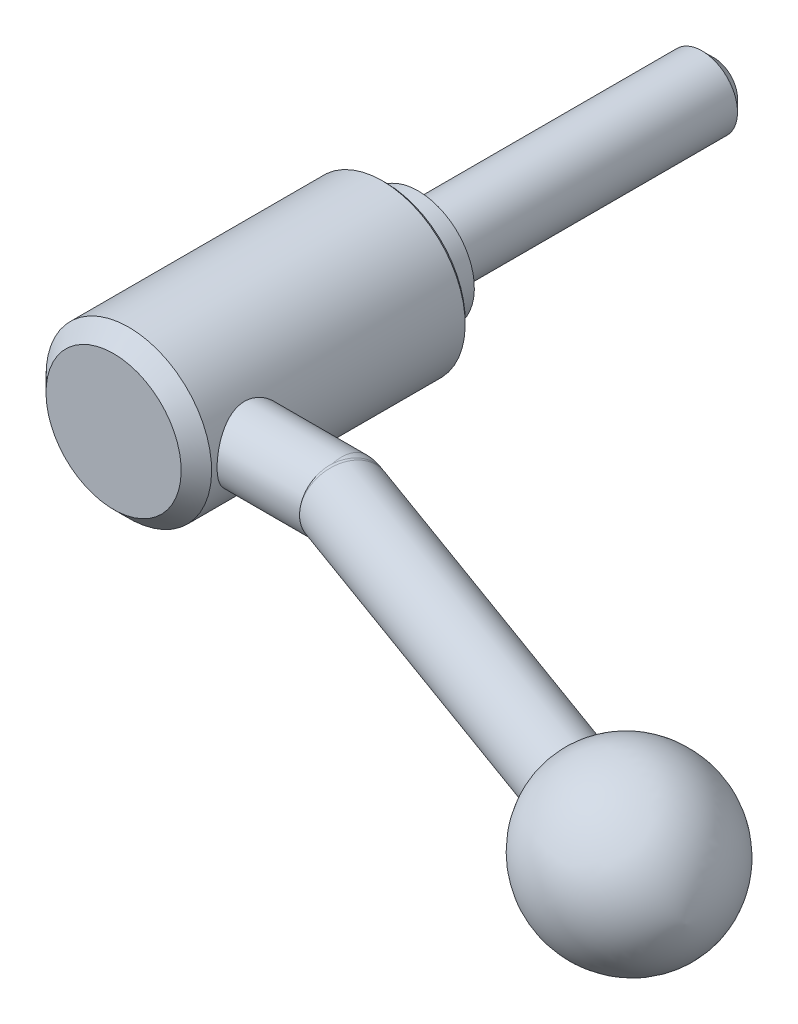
ISO-10303-21;
HEADER;
FILE_DESCRIPTION(('STEP AP214'),'2;1');
FILE_NAME('part.step','',(''),(''),'','','');
FILE_SCHEMA(('AUTOMOTIVE_DESIGN { 1 0 10303 214 1 1 1 1 }'));
ENDSEC;
DATA;
#1=APPLICATION_CONTEXT('core data for automotive mechanical design processes');
#2=APPLICATION_PROTOCOL_DEFINITION('international standard','automotive_design',2000,#1);
#3=PRODUCT_CONTEXT('',#1,'mechanical');
#4=PRODUCT('Part','Part','',(#3));
#5=PRODUCT_RELATED_PRODUCT_CATEGORY('part','',(#4));
#6=PRODUCT_DEFINITION_FORMATION('','',#4);
#7=PRODUCT_DEFINITION_CONTEXT('part definition',#1,'design');
#8=PRODUCT_DEFINITION('design','',#6,#7);
#9=PRODUCT_DEFINITION_SHAPE('','',#8);
#10=(LENGTH_UNIT() NAMED_UNIT(*) SI_UNIT(.MILLI.,.METRE.));
#11=(NAMED_UNIT(*) PLANE_ANGLE_UNIT() SI_UNIT($,.RADIAN.));
#12=(NAMED_UNIT(*) SI_UNIT($,.STERADIAN.) SOLID_ANGLE_UNIT());
#13=UNCERTAINTY_MEASURE_WITH_UNIT(LENGTH_MEASURE(1.E-05),#10,'distance_accuracy_value','');
#14=(GEOMETRIC_REPRESENTATION_CONTEXT(3) GLOBAL_UNCERTAINTY_ASSIGNED_CONTEXT((#13)) GLOBAL_UNIT_ASSIGNED_CONTEXT((#10,
#11,#12)) REPRESENTATION_CONTEXT('',''));
#15=CARTESIAN_POINT('',(0.,0.,0.));
#16=DIRECTION('',(0.,0.,1.));
#17=DIRECTION('',(1.,0.,0.));
#18=AXIS2_PLACEMENT_3D('',#15,#16,#17);
#19=CARTESIAN_POINT('',(0.,0.,0.));
#20=DIRECTION('',(0.,0.,-1.));
#21=DIRECTION('',(0.,1.,0.));
#22=AXIS2_PLACEMENT_3D('',#19,#20,#21);
#23=CYLINDRICAL_SURFACE('',#22,14.);
#24=CARTESIAN_POINT('',(0.,0.,6.05));
#25=DIRECTION('',(0.,0.,-1.));
#26=DIRECTION('',(0.,1.,0.));
#27=AXIS2_PLACEMENT_3D('',#24,#25,#26);
#28=CIRCLE('',#27,14.);
#29=CARTESIAN_POINT('',(0.,14.,6.05));
#30=VERTEX_POINT('',#29);
#31=EDGE_CURVE('E160',#30,#30,#28,.T.);
#32=ORIENTED_EDGE('',*,*,#31,.F.);
#33=EDGE_LOOP('',(#32));
#34=FACE_BOUND('',#33,.T.);
#35=CARTESIAN_POINT('',(12.6491106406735,6.,42.));
#36=CARTESIAN_POINT('',(12.6491119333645,5.99999879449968,42.1596004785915));
#37=CARTESIAN_POINT('',(12.6521417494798,5.99362272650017,42.319252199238));
#38=CARTESIAN_POINT('',(12.6641604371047,5.96818497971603,42.6373858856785));
#39=CARTESIAN_POINT('',(12.6731530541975,5.9491153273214,42.7958670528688));
#40=CARTESIAN_POINT('',(12.6968113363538,5.89845433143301,43.1107250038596));
#41=CARTESIAN_POINT('',(12.7114886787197,5.86683721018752,43.2670967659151));
#42=CARTESIAN_POINT('',(12.7460281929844,5.79141457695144,43.5763457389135));
#43=CARTESIAN_POINT('',(12.7658925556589,5.74760391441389,43.7292214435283));
#44=CARTESIAN_POINT('',(12.8100655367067,5.64846416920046,44.029718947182));
#45=CARTESIAN_POINT('',(12.834352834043,5.59319017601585,44.177362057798));
#46=CARTESIAN_POINT('',(12.8867070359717,5.47148691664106,44.467303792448));
#47=CARTESIAN_POINT('',(12.9147753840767,5.40505338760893,44.6096003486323));
#48=CARTESIAN_POINT('',(13.0034453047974,5.18984372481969,45.0271066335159));
#49=CARTESIAN_POINT('',(13.0685687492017,5.02503655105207,45.2932994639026));
#50=CARTESIAN_POINT('',(13.2082270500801,4.64606142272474,45.8109410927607));
#51=CARTESIAN_POINT('',(13.2830918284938,4.42953098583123,46.0605561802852));
#52=CARTESIAN_POINT('',(13.4311425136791,3.95794082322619,46.5214200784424));
#53=CARTESIAN_POINT('',(13.5043277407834,3.70286580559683,46.7326535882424));
#54=CARTESIAN_POINT('',(13.6088499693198,3.28949768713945,47.0208851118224));
#55=CARTESIAN_POINT('',(13.6435186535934,3.14296205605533,47.11390422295));
#56=CARTESIAN_POINT('',(13.7094062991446,2.84181000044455,47.2871776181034));
#57=CARTESIAN_POINT('',(13.7406265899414,2.68719672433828,47.3674368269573));
#58=CARTESIAN_POINT('',(13.798716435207,2.37092404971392,47.5144478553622));
#59=CARTESIAN_POINT('',(13.8255866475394,2.2092657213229,47.5812017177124));
#60=CARTESIAN_POINT('',(13.8741880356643,1.88004748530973,47.7005320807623));
#61=CARTESIAN_POINT('',(13.895919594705,1.71248801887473,47.7531096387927));
#62=CARTESIAN_POINT('',(13.9325503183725,1.38207962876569,47.8410157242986));
#63=CARTESIAN_POINT('',(13.9477579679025,1.21947370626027,47.8771298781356));
#64=CARTESIAN_POINT('',(13.9725603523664,0.891408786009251,47.9357518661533));
#65=CARTESIAN_POINT('',(13.9821554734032,0.725949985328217,47.9582606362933));
#66=CARTESIAN_POINT('',(13.9954554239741,0.393553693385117,47.9894048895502));
#67=CARTESIAN_POINT('',(13.9991623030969,0.226616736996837,47.9980452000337));
#68=CARTESIAN_POINT('',(14.0005839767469,-0.107418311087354,48.0013627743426));
#69=CARTESIAN_POINT('',(13.9982990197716,-0.274516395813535,47.996040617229));
#70=CARTESIAN_POINT('',(13.9881447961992,-0.596733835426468,47.9722942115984));
#71=CARTESIAN_POINT('',(13.9806457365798,-0.751929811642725,47.9547383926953));
#72=CARTESIAN_POINT('',(13.9606520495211,-1.06021754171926,47.9076442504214));
#73=CARTESIAN_POINT('',(13.9481558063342,-1.21330859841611,47.8781020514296));
#74=CARTESIAN_POINT('',(13.9184825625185,-1.51624558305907,47.807339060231));
#75=CARTESIAN_POINT('',(13.9013071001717,-1.66609256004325,47.7661221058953));
#76=CARTESIAN_POINT('',(13.8626834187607,-1.96169333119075,47.6723729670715));
#77=CARTESIAN_POINT('',(13.8412335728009,-2.10744554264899,47.6198364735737));
#78=CARTESIAN_POINT('',(13.7942200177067,-2.39607632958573,47.5030361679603));
#79=CARTESIAN_POINT('',(13.7685998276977,-2.53887984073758,47.4386094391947));
#80=CARTESIAN_POINT('',(13.7140859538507,-2.81854325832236,47.2990820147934));
#81=CARTESIAN_POINT('',(13.6851910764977,-2.9554009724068,47.2239774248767));
#82=CARTESIAN_POINT('',(13.5945766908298,-3.35592063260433,46.9834369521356));
#83=CARTESIAN_POINT('',(13.5288965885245,-3.60971063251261,46.8027004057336));
#84=CARTESIAN_POINT('',(13.3878711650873,-4.10313412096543,46.3903719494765));
#85=CARTESIAN_POINT('',(13.3121702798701,-4.34033236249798,46.1560074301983));
#86=CARTESIAN_POINT('',(13.1631451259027,-4.77326595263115,45.6505491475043));
#87=CARTESIAN_POINT('',(13.0898218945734,-4.96898340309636,45.3794396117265));
#88=CARTESIAN_POINT('',(12.9865629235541,-5.2305288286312,44.9447706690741));
#89=CARTESIAN_POINT('',(12.9527260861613,-5.31354333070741,44.7922272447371));
#90=CARTESIAN_POINT('',(12.8890027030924,-5.46630143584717,44.4798640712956));
#91=CARTESIAN_POINT('',(12.8591145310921,-5.53605050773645,44.3200473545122));
#92=CARTESIAN_POINT('',(12.8043472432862,-5.66157110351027,43.9942625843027));
#93=CARTESIAN_POINT('',(12.7794661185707,-5.7173482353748,43.8282970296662));
#94=CARTESIAN_POINT('',(12.7356345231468,-5.81433157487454,43.4913958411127));
#95=CARTESIAN_POINT('',(12.7166834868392,-5.85553917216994,43.3204606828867));
#96=CARTESIAN_POINT('',(12.6865220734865,-5.9205872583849,42.9866991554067));
#97=CARTESIAN_POINT('',(12.6748757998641,-5.94541170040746,42.824103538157));
#98=CARTESIAN_POINT('',(12.6578221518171,-5.98163380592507,42.4971025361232));
#99=CARTESIAN_POINT('',(12.6524143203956,-5.99303245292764,42.3326972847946));
#100=CARTESIAN_POINT('',(12.6480404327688,-6.00225784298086,42.0034733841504));
#101=CARTESIAN_POINT('',(12.6490723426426,-6.00008887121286,41.8386548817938));
#102=CARTESIAN_POINT('',(12.6575345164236,-5.98221680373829,41.5099230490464));
#103=CARTESIAN_POINT('',(12.6649645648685,-5.96651416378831,41.3460096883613));
#104=CARTESIAN_POINT('',(12.685211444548,-5.92333782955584,41.0317850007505));
#105=CARTESIAN_POINT('',(12.6976163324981,-5.89676170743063,40.8813224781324));
#106=CARTESIAN_POINT('',(12.7273370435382,-5.83233654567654,40.5832773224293));
#107=CARTESIAN_POINT('',(12.7446544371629,-5.79448390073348,40.435695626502));
#108=CARTESIAN_POINT('',(12.7836779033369,-5.70787446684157,40.1443991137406));
#109=CARTESIAN_POINT('',(12.8053831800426,-5.65911965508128,40.0006836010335));
#110=CARTESIAN_POINT('',(12.8525781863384,-5.55109972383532,39.7178468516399));
#111=CARTESIAN_POINT('',(12.8780693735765,-5.49183055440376,39.5787274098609));
#112=CARTESIAN_POINT('',(12.9333207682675,-5.36045709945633,39.2999549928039));
#113=CARTESIAN_POINT('',(12.9632176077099,-5.28790975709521,39.160537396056));
#114=CARTESIAN_POINT('',(13.0255703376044,-5.13240219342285,38.8882359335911));
#115=CARTESIAN_POINT('',(13.0580270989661,-5.04943842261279,38.7553543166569));
#116=CARTESIAN_POINT('',(13.1580121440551,-4.78560208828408,38.3674196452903));
#117=CARTESIAN_POINT('',(13.2281845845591,-4.58971750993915,38.1229353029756));
#118=CARTESIAN_POINT('',(13.3366249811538,-4.26021445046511,37.7715869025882));
#119=CARTESIAN_POINT('',(13.3748529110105,-4.13892354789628,37.6527973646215));
#120=CARTESIAN_POINT('',(13.4503551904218,-3.88654904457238,37.4257795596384));
#121=CARTESIAN_POINT('',(13.4876298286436,-3.75546845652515,37.3175480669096));
#122=CARTESIAN_POINT('',(13.5602429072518,-3.48418488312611,37.1123202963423));
#123=CARTESIAN_POINT('',(13.5955803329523,-3.34397719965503,37.0153298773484));
#124=CARTESIAN_POINT('',(13.6633349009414,-3.05536185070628,36.8333913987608));
#125=CARTESIAN_POINT('',(13.6957533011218,-2.90695776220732,36.7484381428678));
#126=CARTESIAN_POINT('',(13.7569620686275,-2.60198219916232,36.5908122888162));
#127=CARTESIAN_POINT('',(13.78573175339,-2.44537070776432,36.5182089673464));
#128=CARTESIAN_POINT('',(13.8386034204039,-2.12585519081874,36.3865716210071));
#129=CARTESIAN_POINT('',(13.862707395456,-1.96295388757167,36.3275318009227));
#130=CARTESIAN_POINT('',(13.9055467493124,-1.63205123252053,36.2236281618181));
#131=CARTESIAN_POINT('',(13.9242837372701,-1.46405142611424,36.1787600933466));
#132=CARTESIAN_POINT('',(13.9558282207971,-1.12426022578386,36.1037042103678));
#133=CARTESIAN_POINT('',(13.9686361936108,-0.952469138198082,36.0735152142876));
#134=CARTESIAN_POINT('',(13.9872197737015,-0.619242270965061,36.0298514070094));
#135=CARTESIAN_POINT('',(13.9934418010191,-0.457969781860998,36.0153142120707));
#136=CARTESIAN_POINT('',(14.0002858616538,-0.134661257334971,35.9993285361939));
#137=CARTESIAN_POINT('',(14.0009081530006,0.0273747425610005,35.99787945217));
#138=CARTESIAN_POINT('',(13.9965361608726,0.350926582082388,36.008085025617));
#139=CARTESIAN_POINT('',(13.991542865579,0.512442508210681,36.0197373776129));
#140=CARTESIAN_POINT('',(13.976077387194,0.833743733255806,36.0560107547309));
#141=CARTESIAN_POINT('',(13.9656052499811,0.993529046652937,36.0806316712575));
#142=CARTESIAN_POINT('',(13.9399800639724,1.30393627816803,36.1413509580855));
#143=CARTESIAN_POINT('',(13.9250277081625,1.45467118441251,36.176958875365));
#144=CARTESIAN_POINT('',(13.89068609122,1.75251852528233,36.2595669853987));
#145=CARTESIAN_POINT('',(13.8712953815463,1.89962975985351,36.3065708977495));
#146=CARTESIAN_POINT('',(13.8285434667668,2.18924878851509,36.4115377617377));
#147=CARTESIAN_POINT('',(13.8051831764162,2.33175763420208,36.4694981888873));
#148=CARTESIAN_POINT('',(13.7550167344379,2.61145800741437,36.5959410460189));
#149=CARTESIAN_POINT('',(13.7282092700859,2.74864748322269,36.6644274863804));
#150=CARTESIAN_POINT('',(13.6704759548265,3.02301487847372,36.8147378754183));
#151=CARTESIAN_POINT('',(13.639418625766,3.1599112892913,36.8970251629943));
#152=CARTESIAN_POINT('',(13.5749315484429,3.42637329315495,37.0719801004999));
#153=CARTESIAN_POINT('',(13.5415009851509,3.55593634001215,37.1646513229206));
#154=CARTESIAN_POINT('',(13.4730570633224,3.80705581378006,37.3597829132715));
#155=CARTESIAN_POINT('',(13.4380434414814,3.9286109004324,37.4622449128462));
#156=CARTESIAN_POINT('',(13.3672591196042,4.16309810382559,37.6763643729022));
#157=CARTESIAN_POINT('',(13.3314883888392,4.27602986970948,37.7880222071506));
#158=CARTESIAN_POINT('',(13.257431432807,4.50061025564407,38.02841367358));
#159=CARTESIAN_POINT('',(13.2191519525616,4.61156500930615,38.1577987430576));
#160=CARTESIAN_POINT('',(13.1437838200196,4.82218384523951,38.4257073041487));
#161=CARTESIAN_POINT('',(13.1066947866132,4.92185156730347,38.5642278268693));
#162=CARTESIAN_POINT('',(13.0347422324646,5.10936324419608,38.8498227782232));
#163=CARTESIAN_POINT('',(12.9998810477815,5.19719489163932,38.9969058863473));
#164=CARTESIAN_POINT('',(12.9335248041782,5.36019403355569,39.2985749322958));
#165=CARTESIAN_POINT('',(12.9020282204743,5.43536727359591,39.4531574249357));
#166=CARTESIAN_POINT('',(12.8434648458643,5.57233851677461,39.7687244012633));
#167=CARTESIAN_POINT('',(12.8163926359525,5.63415291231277,39.9297007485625));
#168=CARTESIAN_POINT('',(12.7676047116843,5.74385568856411,40.2570433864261));
#169=CARTESIAN_POINT('',(12.7458863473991,5.79175096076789,40.4234069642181));
#170=CARTESIAN_POINT('',(12.7086612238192,5.87298255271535,40.7598587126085));
#171=CARTESIAN_POINT('',(12.6931381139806,5.90635721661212,40.9299358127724));
#172=CARTESIAN_POINT('',(12.6688496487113,5.95827833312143,41.2727263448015));
#173=CARTESIAN_POINT('',(12.6600791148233,5.97683614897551,41.4454376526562));
#174=CARTESIAN_POINT('',(12.6529445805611,5.99191158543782,41.6821226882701));
#175=CARTESIAN_POINT('',(12.6515079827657,5.99494373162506,41.7456483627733));
#176=CARTESIAN_POINT('',(12.6495907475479,5.998988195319,41.8727799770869));
#177=CARTESIAN_POINT('',(12.6491101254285,6.00000048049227,41.936385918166));
#178=CARTESIAN_POINT('',(12.6491106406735,6.,42.));
#179=B_SPLINE_CURVE_WITH_KNOTS('',3,(#35,#36,#37,#38,#39,#40,#41,#42,#43,#44,#45,#46,#47,#48,
#49,#50,#51,#52,#53,#54,#55,#56,#57,#58,#59,#60,#61,#62,#63,#64,#65,#66,#67,#68,#69,#70,#71,#72,
#73,#74,#75,#76,#77,#78,#79,#80,#81,#82,#83,#84,#85,#86,#87,#88,#89,#90,#91,#92,#93,#94,#95,#96,
#97,#98,#99,#100,#101,#102,#103,#104,#105,#106,#107,#108,#109,#110,#111,#112,#113,#114,#115,
#116,#117,#118,#119,#120,#121,#122,#123,#124,#125,#126,#127,#128,#129,#130,#131,#132,#133,#134,
#135,#136,#137,#138,#139,#140,#141,#142,#143,#144,#145,#146,#147,#148,#149,#150,#151,#152,#153,
#154,#155,#156,#157,#158,#159,#160,#161,#162,#163,#164,#165,#166,#167,#168,#169,#170,#171,#172,
#173,#174,#175,#176,#177,#178),.UNSPECIFIED.,.T.,.F.,(4,2,2,2,2,2,2,2,2,2,2,2,2,2,2,2,2,2,2,2,2,
2,2,2,2,2,2,2,2,2,2,2,2,2,2,2,2,2,2,2,2,2,2,2,2,2,2,2,2,2,2,2,2,2,2,2,2,2,2,2,2,2,2,2,2,2,2,2,2,
2,2,4),(0.,0.478735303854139,0.957771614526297,1.43779720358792,1.91802586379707,
2.39599804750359,2.87415322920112,3.82930565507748,4.84157827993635,5.85425356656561,
6.38467511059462,6.91489143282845,7.44502749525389,7.97512400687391,8.47625092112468,
8.9773433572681,9.47826133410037,9.97915853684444,10.4477041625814,10.9164014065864,
11.3849447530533,11.8536667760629,12.3293655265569,12.8052382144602,13.756394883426,
14.7778987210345,15.7998424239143,16.330075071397,16.8600886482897,17.3898891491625,
17.9196391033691,18.4136567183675,18.9076381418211,19.4014635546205,19.8952723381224,
20.354632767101,20.814140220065,21.2735644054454,21.7331659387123,22.2125740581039,
22.6921459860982,23.6508169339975,24.1724207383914,24.6938646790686,25.2155791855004,
25.7370677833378,26.2613915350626,26.7854908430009,27.3094328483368,27.8333326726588,
28.3188546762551,28.8043543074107,29.2897685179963,29.7751786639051,30.2414628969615,
30.7078995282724,31.1742288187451,31.6407362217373,32.1283561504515,32.6161443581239,
33.1040139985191,33.5919034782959,34.1153644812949,34.6386561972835,35.1624879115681,
35.6860812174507,36.2090283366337,36.7317160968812,37.253015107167,37.7739139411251,
37.9647267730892,38.1555426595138),.UNSPECIFIED.);
#180=CARTESIAN_POINT('',(12.6491106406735,6.,42.));
#181=VERTEX_POINT('',#180);
#182=EDGE_CURVE('E79',#181,#181,#179,.T.);
#183=ORIENTED_EDGE('',*,*,#182,.F.);
#184=EDGE_LOOP('',(#183));
#185=FACE_BOUND('',#184,.T.);
#186=CARTESIAN_POINT('',(0.,0.,48.925));
#187=DIRECTION('',(0.,0.,-1.));
#188=DIRECTION('',(0.,1.,0.));
#189=AXIS2_PLACEMENT_3D('',#186,#187,#188);
#190=CIRCLE('',#189,14.);
#191=CARTESIAN_POINT('',(0.,14.,48.925));
#192=VERTEX_POINT('',#191);
#193=EDGE_CURVE('E163',#192,#192,#190,.T.);
#194=ORIENTED_EDGE('',*,*,#193,.T.);
#195=EDGE_LOOP('',(#194));
#196=FACE_BOUND('',#195,.T.);
#197=ADVANCED_FACE('F15',(#34,#185,#196),#23,.T.);
#198=CARTESIAN_POINT('',(0.,0.,51.5));
#199=DIRECTION('',(0.,0.,-1.));
#200=DIRECTION('',(0.,1.,0.));
#201=AXIS2_PLACEMENT_3D('',#198,#199,#200);
#202=PLANE('',#201);
#203=CARTESIAN_POINT('',(0.,0.,51.5));
#204=DIRECTION('',(0.,0.,-1.));
#205=DIRECTION('',(0.,1.,0.));
#206=AXIS2_PLACEMENT_3D('',#203,#204,#205);
#207=CIRCLE('',#206,11.425);
#208=CARTESIAN_POINT('',(0.,11.425,51.5));
#209=VERTEX_POINT('',#208);
#210=EDGE_CURVE('E88',#209,#209,#207,.T.);
#211=ORIENTED_EDGE('',*,*,#210,.F.);
#212=EDGE_LOOP('',(#211));
#213=FACE_BOUND('',#212,.T.);
#214=ADVANCED_FACE('F63',(#213),#202,.F.);
#215=CARTESIAN_POINT('',(0.,0.,51.5));
#216=DIRECTION('',(0.,0.,-1.));
#217=DIRECTION('',(0.,1.,0.));
#218=AXIS2_PLACEMENT_3D('',#215,#216,#217);
#219=CONICAL_SURFACE('',#218,11.425,0.785398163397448);
#220=ORIENTED_EDGE('',*,*,#193,.F.);
#221=EDGE_LOOP('',(#220));
#222=FACE_BOUND('',#221,.T.);
#223=ORIENTED_EDGE('',*,*,#210,.T.);
#224=EDGE_LOOP('',(#223));
#225=FACE_BOUND('',#224,.T.);
#226=ADVANCED_FACE('F69',(#222,#225),#219,.T.);
#227=CARTESIAN_POINT('',(0.,0.,6.05));
#228=DIRECTION('',(0.,0.,1.));
#229=DIRECTION('',(0.,-1.,0.));
#230=AXIS2_PLACEMENT_3D('',#227,#228,#229);
#231=CONICAL_SURFACE('',#230,14.,0.785398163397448);
#232=CARTESIAN_POINT('',(0.,0.,5.5));
#233=DIRECTION('',(0.,0.,-1.));
#234=DIRECTION('',(0.,1.,0.));
#235=AXIS2_PLACEMENT_3D('',#232,#233,#234);
#236=CIRCLE('',#235,13.45);
#237=CARTESIAN_POINT('',(0.,13.45,5.5));
#238=VERTEX_POINT('',#237);
#239=EDGE_CURVE('E154',#238,#238,#236,.T.);
#240=ORIENTED_EDGE('',*,*,#239,.F.);
#241=EDGE_LOOP('',(#240));
#242=FACE_BOUND('',#241,.T.);
#243=ORIENTED_EDGE('',*,*,#31,.T.);
#244=EDGE_LOOP('',(#243));
#245=FACE_BOUND('',#244,.T.);
#246=ADVANCED_FACE('F76',(#242,#245),#231,.T.);
#247=CARTESIAN_POINT('',(13.45,0.,5.5));
#248=DIRECTION('',(0.,0.,1.));
#249=DIRECTION('',(0.,-1.,0.));
#250=AXIS2_PLACEMENT_3D('',#247,#248,#249);
#251=PLANE('',#250);
#252=CARTESIAN_POINT('',(0.,0.,5.5));
#253=DIRECTION('',(0.,0.,-1.));
#254=DIRECTION('',(0.,1.,0.));
#255=AXIS2_PLACEMENT_3D('',#252,#253,#254);
#256=CIRCLE('',#255,9.5);
#257=CARTESIAN_POINT('',(0.,9.5,5.5));
#258=VERTEX_POINT('',#257);
#259=EDGE_CURVE('E150',#258,#258,#256,.T.);
#260=ORIENTED_EDGE('',*,*,#259,.F.);
#261=EDGE_LOOP('',(#260));
#262=FACE_BOUND('',#261,.T.);
#263=ORIENTED_EDGE('',*,*,#239,.T.);
#264=EDGE_LOOP('',(#263));
#265=FACE_BOUND('',#264,.T.);
#266=ADVANCED_FACE('F177',(#262,#265),#251,.F.);
#267=CARTESIAN_POINT('',(0.,0.,0.));
#268=DIRECTION('',(0.,0.,-1.));
#269=DIRECTION('',(0.,1.,0.));
#270=AXIS2_PLACEMENT_3D('',#267,#268,#269);
#271=CYLINDRICAL_SURFACE('',#270,9.5);
#272=CARTESIAN_POINT('',(0.,0.,0.));
#273=DIRECTION('',(0.,0.,-1.));
#274=DIRECTION('',(0.,1.,0.));
#275=AXIS2_PLACEMENT_3D('',#272,#273,#274);
#276=CIRCLE('',#275,9.5);
#277=CARTESIAN_POINT('',(0.,9.5,0.));
#278=VERTEX_POINT('',#277);
#279=EDGE_CURVE('E147',#278,#278,#276,.T.);
#280=ORIENTED_EDGE('',*,*,#279,.F.);
#281=EDGE_LOOP('',(#280));
#282=FACE_BOUND('',#281,.T.);
#283=ORIENTED_EDGE('',*,*,#259,.T.);
#284=EDGE_LOOP('',(#283));
#285=FACE_BOUND('',#284,.T.);
#286=ADVANCED_FACE('F144',(#282,#285),#271,.T.);
#287=CARTESIAN_POINT('',(9.5,0.,0.));
#288=DIRECTION('',(0.,0.,1.));
#289=DIRECTION('',(0.,-1.,0.));
#290=AXIS2_PLACEMENT_3D('',#287,#288,#289);
#291=PLANE('',#290);
#292=CARTESIAN_POINT('',(0.,0.,0.));
#293=DIRECTION('',(0.,0.,-1.));
#294=DIRECTION('',(0.,1.,0.));
#295=AXIS2_PLACEMENT_3D('',#292,#293,#294);
#296=CIRCLE('',#295,6.);
#297=CARTESIAN_POINT('',(0.,6.,0.));
#298=VERTEX_POINT('',#297);
#299=EDGE_CURVE('E134',#298,#298,#296,.T.);
#300=ORIENTED_EDGE('',*,*,#299,.F.);
#301=EDGE_LOOP('',(#300));
#302=FACE_BOUND('',#301,.T.);
#303=ORIENTED_EDGE('',*,*,#279,.T.);
#304=EDGE_LOOP('',(#303));
#305=FACE_BOUND('',#304,.T.);
#306=ADVANCED_FACE('F96',(#302,#305),#291,.F.);
#307=CARTESIAN_POINT('',(35.,0.,42.));
#308=DIRECTION('',(1.,0.,0.));
#309=DIRECTION('',(0.,1.,0.));
#310=AXIS2_PLACEMENT_3D('',#307,#308,#309);
#311=CYLINDRICAL_SURFACE('',#310,6.);
#312=CARTESIAN_POINT('',(29.0002,-5.79737991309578,43.546087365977));
#313=CARTESIAN_POINT('',(28.9724990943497,-5.77707543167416,43.6222362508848));
#314=CARTESIAN_POINT('',(28.9459271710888,-5.75516638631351,43.6983487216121));
#315=CARTESIAN_POINT('',(28.894739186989,-5.70814835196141,43.8502306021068));
#316=CARTESIAN_POINT('',(28.8701228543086,-5.68303980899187,43.9260000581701));
#317=CARTESIAN_POINT('',(28.7987695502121,-5.6029491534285,44.1523368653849));
#318=CARTESIAN_POINT('',(28.7544982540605,-5.54317949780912,44.3020176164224));
#319=CARTESIAN_POINT('',(28.6711793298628,-5.41121602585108,44.5970862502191));
#320=CARTESIAN_POINT('',(28.6321268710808,-5.3390338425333,44.7424780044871));
#321=CARTESIAN_POINT('',(28.5583361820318,-5.18257721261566,45.0277646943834));
#322=CARTESIAN_POINT('',(28.5235982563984,-5.09830191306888,45.1676592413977));
#323=CARTESIAN_POINT('',(28.4579073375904,-4.91822874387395,45.4406017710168));
#324=CARTESIAN_POINT('',(28.4269515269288,-4.82243955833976,45.5736548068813));
#325=CARTESIAN_POINT('',(28.3684157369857,-4.61988344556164,45.8319198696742));
#326=CARTESIAN_POINT('',(28.3408357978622,-4.5131163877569,45.9571318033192));
#327=CARTESIAN_POINT('',(28.2887910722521,-4.28931411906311,46.1986769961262));
#328=CARTESIAN_POINT('',(28.264325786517,-4.17228055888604,46.3150116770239));
#329=CARTESIAN_POINT('',(28.2183149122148,-3.92870690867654,46.537897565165));
#330=CARTESIAN_POINT('',(28.1967693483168,-3.8021667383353,46.6444486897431));
#331=CARTESIAN_POINT('',(28.1562496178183,-3.53907309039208,46.8479799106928));
#332=CARTESIAN_POINT('',(28.1373045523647,-3.40242909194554,46.944848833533));
#333=CARTESIAN_POINT('',(28.1021430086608,-3.12121919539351,47.1269937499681));
#334=CARTESIAN_POINT('',(28.0859274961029,-2.97665051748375,47.212265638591));
#335=CARTESIAN_POINT('',(28.0561585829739,-2.68068805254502,47.3704807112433));
#336=CARTESIAN_POINT('',(28.0426047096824,-2.52929548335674,47.4434260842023));
#337=CARTESIAN_POINT('',(28.0180943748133,-2.2206886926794,47.5764491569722));
#338=CARTESIAN_POINT('',(28.0071388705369,-2.063472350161,47.6365221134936));
#339=CARTESIAN_POINT('',(27.987872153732,-1.74574860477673,47.7428380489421));
#340=CARTESIAN_POINT('',(27.97953948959,-1.5852799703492,47.7891930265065));
#341=CARTESIAN_POINT('',(27.965363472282,-1.26087148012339,47.8683977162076));
#342=CARTESIAN_POINT('',(27.9595210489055,-1.09693035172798,47.9012423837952));
#343=CARTESIAN_POINT('',(27.950314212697,-0.766902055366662,47.9531293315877));
#344=CARTESIAN_POINT('',(27.9469484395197,-0.600816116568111,47.972179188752));
#345=CARTESIAN_POINT('',(27.9426785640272,-0.267526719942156,47.9963621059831));
#346=CARTESIAN_POINT('',(27.9417755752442,-0.100322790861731,48.0014888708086));
#347=CARTESIAN_POINT('',(27.9424301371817,0.233076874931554,47.9977768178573));
#348=CARTESIAN_POINT('',(27.943975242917,0.399273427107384,47.9890086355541));
#349=CARTESIAN_POINT('',(27.9495060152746,0.730248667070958,47.9577139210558));
#350=CARTESIAN_POINT('',(27.9534905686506,0.895027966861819,47.9351936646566));
#351=CARTESIAN_POINT('',(27.9639138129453,1.22215531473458,47.8765604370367));
#352=CARTESIAN_POINT('',(27.9703537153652,1.38450212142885,47.8404407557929));
#353=CARTESIAN_POINT('',(27.9857050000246,1.70547020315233,47.7549062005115));
#354=CARTESIAN_POINT('',(27.9946154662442,1.86409283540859,47.7054962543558));
#355=CARTESIAN_POINT('',(28.0149428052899,2.17661167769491,47.5937385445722));
#356=CARTESIAN_POINT('',(28.0263605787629,2.33050616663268,47.5313861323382));
#357=CARTESIAN_POINT('',(28.0517386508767,2.63237333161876,47.3942638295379));
#358=CARTESIAN_POINT('',(28.0656980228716,2.78034814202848,47.3194984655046));
#359=CARTESIAN_POINT('',(28.0962237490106,3.06943625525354,47.1580977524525));
#360=CARTESIAN_POINT('',(28.1127906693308,3.21054805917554,47.0714598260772));
#361=CARTESIAN_POINT('',(28.1486024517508,3.48485557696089,46.8870325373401));
#362=CARTESIAN_POINT('',(28.1678464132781,3.61805393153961,46.789246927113));
#363=CARTESIAN_POINT('',(28.2092310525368,3.87634885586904,46.5827287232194));
#364=CARTESIAN_POINT('',(28.2313862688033,4.00139970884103,46.4739418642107));
#365=CARTESIAN_POINT('',(28.2786635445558,4.24179144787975,46.2467117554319));
#366=CARTESIAN_POINT('',(28.303785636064,4.35713222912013,46.128268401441));
#367=CARTESIAN_POINT('',(28.3572036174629,4.57734862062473,45.8826648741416));
#368=CARTESIAN_POINT('',(28.38549985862,4.68222307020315,45.7555037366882));
#369=CARTESIAN_POINT('',(28.445549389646,4.88081288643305,45.4935198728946));
#370=CARTESIAN_POINT('',(28.4773025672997,4.97452861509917,45.3586973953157));
#371=CARTESIAN_POINT('',(28.5429262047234,5.14565563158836,45.0897088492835));
#372=CARTESIAN_POINT('',(28.5766009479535,5.22366104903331,44.9558726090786));
#373=CARTESIAN_POINT('',(28.647938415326,5.36870734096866,44.6834298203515));
#374=CARTESIAN_POINT('',(28.6856006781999,5.43574948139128,44.5448238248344));
#375=CARTESIAN_POINT('',(28.7657142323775,5.55859867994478,44.2639502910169));
#376=CARTESIAN_POINT('',(28.8081677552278,5.61440046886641,44.1216810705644));
#377=CARTESIAN_POINT('',(28.8763731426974,5.68948565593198,43.9067054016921));
#378=CARTESIAN_POINT('',(28.8998696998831,5.7130832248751,43.8347644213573));
#379=CARTESIAN_POINT('',(28.9486375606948,5.7573957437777,43.6905883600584));
#380=CARTESIAN_POINT('',(28.9739090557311,5.77811038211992,43.6183532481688));
#381=CARTESIAN_POINT('',(29.0001999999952,5.79737991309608,43.546087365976));
#382=B_SPLINE_CURVE_WITH_KNOTS('',3,(#312,#313,#314,#315,#316,#317,#318,#319,#320,#321,#322,
#323,#324,#325,#326,#327,#328,#329,#330,#331,#332,#333,#334,#335,#336,#337,#338,#339,#340,#341,
#342,#343,#344,#345,#346,#347,#348,#349,#350,#351,#352,#353,#354,#355,#356,#357,#358,#359,#360,
#361,#362,#363,#364,#365,#366,#367,#368,#369,#370,#371,#372,#373,#374,#375,#376,#377,#378,#379,
#380,#381),.UNSPECIFIED.,.F.,.F.,(4,2,2,2,2,2,2,2,2,2,2,2,2,2,2,2,2,2,2,2,2,2,2,2,2,2,2,2,2,2,2,
2,2,2,4),(0.,0.250554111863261,0.501073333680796,1.00183412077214,1.50212812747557,
2.0024574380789,2.50241172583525,3.00237196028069,3.50225195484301,4.00213617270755,
4.50722386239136,5.01248987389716,5.51766606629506,6.02302808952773,6.52414248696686,
7.02544382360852,7.52646960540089,8.02772188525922,8.52643419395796,9.02491908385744,
9.52365025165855,10.0221967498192,10.5209226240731,11.0194670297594,11.5181198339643,
12.0166052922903,12.5176821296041,13.0187643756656,13.5199021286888,14.0210236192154,
14.4961092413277,14.9711399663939,15.4463928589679,15.684153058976,15.9219389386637),.UNSPECIFIED.);
#383=CARTESIAN_POINT('',(29.,-5.79723335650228,43.5466368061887));
#384=VERTEX_POINT('',#383);
#385=CARTESIAN_POINT('',(27.9420381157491,0.,48.));
#386=VERTEX_POINT('',#385);
#387=EDGE_CURVE('E31',#384,#386,#382,.T.);
#388=ORIENTED_EDGE('',*,*,#387,.T.);
#389=CARTESIAN_POINT('',(29.,5.79723335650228,43.5466368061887));
#390=VERTEX_POINT('',#389);
#391=EDGE_CURVE('E101',#386,#390,#382,.T.);
#392=ORIENTED_EDGE('',*,*,#391,.T.);
#393=CARTESIAN_POINT('',(29.,0.,42.));
#394=DIRECTION('',(1.,0.,0.));
#395=DIRECTION('',(0.,1.,0.));
#396=AXIS2_PLACEMENT_3D('',#393,#394,#395);
#397=CIRCLE('',#396,6.);
#398=EDGE_CURVE('E111',#384,#390,#397,.T.);
#399=ORIENTED_EDGE('',*,*,#398,.F.);
#400=EDGE_LOOP('',(#388,#392,#399));
#401=FACE_BOUND('',#400,.T.);
#402=ORIENTED_EDGE('',*,*,#182,.T.);
#403=EDGE_LOOP('',(#402));
#404=FACE_BOUND('',#403,.T.);
#405=ADVANCED_FACE('F90',(#401,#404),#311,.T.);
#406=CARTESIAN_POINT('',(29.,0.,42.));
#407=DIRECTION('',(1.,0.,0.));
#408=DIRECTION('',(0.,0.,1.));
#409=AXIS2_PLACEMENT_3D('',#406,#407,#408);
#410=SPHERICAL_SURFACE('',#409,6.);
#411=CARTESIAN_POINT('',(29.4970794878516,0.,42.1809221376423));
#412=DIRECTION('',(0.939692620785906,0.,0.342020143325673));
#413=DIRECTION('',(-0.342020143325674,0.,0.939692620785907));
#414=AXIS2_PLACEMENT_3D('',#411,#412,#413);
#415=CIRCLE('',#414,5.97663610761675);
#416=EDGE_CURVE('E38',#384,#390,#415,.T.);
#417=ORIENTED_EDGE('',*,*,#416,.F.);
#418=ORIENTED_EDGE('',*,*,#398,.T.);
#419=EDGE_LOOP('',(#417,#418));
#420=FACE_BOUND('',#419,.T.);
#421=ADVANCED_FACE('F95',(#420),#410,.T.);
#422=CARTESIAN_POINT('',(29.9941589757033,0.,42.3618442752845));
#423=DIRECTION('',(0.939692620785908,0.,0.342020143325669));
#424=DIRECTION('',(-0.342020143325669,0.,0.939692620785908));
#425=AXIS2_PLACEMENT_3D('',#422,#423,#424);
#426=SPHERICAL_SURFACE('',#425,6.);
#427=ORIENTED_EDGE('',*,*,#387,.F.);
#428=ORIENTED_EDGE('',*,*,#416,.T.);
#429=ORIENTED_EDGE('',*,*,#391,.F.);
#430=CARTESIAN_POINT('',(29.9941589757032,0.,42.3618442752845));
#431=DIRECTION('',(0.939692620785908,0.,0.342020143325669));
#432=DIRECTION('',(-0.342020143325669,0.,0.939692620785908));
#433=AXIS2_PLACEMENT_3D('',#430,#431,#432);
#434=CIRCLE('',#433,6.);
#435=EDGE_CURVE('E109',#386,#386,#434,.T.);
#436=ORIENTED_EDGE('',*,*,#435,.F.);
#437=EDGE_LOOP('',(#427,#428,#429,#436));
#438=FACE_BOUND('',#437,.T.);
#439=ADVANCED_FACE('F113',(#438),#426,.T.);
#440=CARTESIAN_POINT('',(120.484247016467,0.,75.2975428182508));
#441=DIRECTION('',(0.939692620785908,0.,0.342020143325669));
#442=DIRECTION('',(-0.342020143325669,0.,0.939692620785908));
#443=AXIS2_PLACEMENT_3D('',#440,#441,#442);
#444=CYLINDRICAL_SURFACE('',#443,6.);
#445=CARTESIAN_POINT('',(93.4815813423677,0.,65.4693762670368));
#446=DIRECTION('',(0.939692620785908,0.,0.342020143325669));
#447=DIRECTION('',(-0.342020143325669,0.,0.939692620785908));
#448=AXIS2_PLACEMENT_3D('',#445,#446,#447);
#449=CIRCLE('',#448,6.);
#450=CARTESIAN_POINT('',(91.4294604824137,0.,71.1075319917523));
#451=VERTEX_POINT('',#450);
#452=EDGE_CURVE('E125',#451,#451,#449,.T.);
#453=ORIENTED_EDGE('',*,*,#452,.F.);
#454=EDGE_LOOP('',(#453));
#455=FACE_BOUND('',#454,.T.);
#456=ORIENTED_EDGE('',*,*,#435,.T.);
#457=EDGE_LOOP('',(#456));
#458=FACE_BOUND('',#457,.T.);
#459=ADVANCED_FACE('F58',(#455,#458),#444,.T.);
#460=CARTESIAN_POINT('',(91.4294604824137,0.,71.1075319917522));
#461=DIRECTION('',(0.939692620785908,0.,0.342020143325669));
#462=DIRECTION('',(-0.342020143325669,0.,0.939692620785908));
#463=AXIS2_PLACEMENT_3D('',#460,#461,#462);
#464=PLANE('',#463);
#465=CARTESIAN_POINT('',(93.4815813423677,0.,65.4693762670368));
#466=DIRECTION('',(0.939692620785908,0.,0.342020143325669));
#467=DIRECTION('',(-0.342020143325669,0.,0.939692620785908));
#468=AXIS2_PLACEMENT_3D('',#465,#466,#467);
#469=CIRCLE('',#468,8.16630341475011);
#470=CARTESIAN_POINT('',(90.688541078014,0.,73.1431913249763));
#471=VERTEX_POINT('',#470);
#472=EDGE_CURVE('E131',#471,#471,#469,.T.);
#473=ORIENTED_EDGE('',*,*,#472,.F.);
#474=EDGE_LOOP('',(#473));
#475=FACE_BOUND('',#474,.T.);
#476=ORIENTED_EDGE('',*,*,#452,.T.);
#477=EDGE_LOOP('',(#476));
#478=FACE_BOUND('',#477,.T.);
#479=ADVANCED_FACE('F47',(#475,#478),#464,.F.);
#480=CARTESIAN_POINT('',(106.,0.,68.5));
#481=DIRECTION('',(0.,0.999999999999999,0.));
#482=DIRECTION('',(-0.342020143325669,0.,0.939692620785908));
#483=AXIS2_PLACEMENT_3D('',#480,#481,#482);
#484=CIRCLE('',#483,16.);
#485=TRIMMED_CURVE('',#484,(PARAMETER_VALUE(-1.48106994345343)),
(PARAMETER_VALUE(1.48106994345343)),.T.,.PARAMETER.);
#486=CARTESIAN_POINT('',(105.509646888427,0.,69.8472341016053));
#487=DIRECTION('',(0.939692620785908,0.,0.342020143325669));
#488=AXIS1_PLACEMENT('',#486,#487);
#489=SURFACE_OF_REVOLUTION('',#485,#488);
#490=ORIENTED_EDGE('',*,*,#472,.T.);
#491=EDGE_LOOP('',(#490));
#492=FACE_BOUND('',#491,.T.);
#493=CARTESIAN_POINT('',(120.484247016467,0.,75.2975428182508));
#494=VERTEX_POINT('',#493);
#495=VERTEX_LOOP('',#494);
#496=FACE_BOUND('',#495,.T.);
#497=ADVANCED_FACE('F44',(#492,#496),#489,.T.);
#498=CARTESIAN_POINT('',(0.,0.,17.));
#499=DIRECTION('',(0.,0.,-1.));
#500=DIRECTION('',(-1.,0.,0.));
#501=AXIS2_PLACEMENT_3D('',#498,#499,#500);
#502=CYLINDRICAL_SURFACE('',#501,6.);
#503=CARTESIAN_POINT('',(0.,0.,-48.));
#504=DIRECTION('',(0.,0.,-1.));
#505=DIRECTION('',(-1.,0.,0.));
#506=AXIS2_PLACEMENT_3D('',#503,#504,#505);
#507=CIRCLE('',#506,6.);
#508=CARTESIAN_POINT('',(-6.,0.,-48.));
#509=VERTEX_POINT('',#508);
#510=EDGE_CURVE('E9',#509,#509,#507,.F.);
#511=ORIENTED_EDGE('',*,*,#510,.T.);
#512=EDGE_LOOP('',(#511));
#513=FACE_BOUND('',#512,.T.);
#514=ORIENTED_EDGE('',*,*,#299,.T.);
#515=EDGE_LOOP('',(#514));
#516=FACE_BOUND('',#515,.T.);
#517=ADVANCED_FACE('F46',(#513,#516),#502,.T.);
#518=CARTESIAN_POINT('',(0.,0.,-50.));
#519=DIRECTION('',(0.,0.,-1.));
#520=DIRECTION('',(-1.,0.,0.));
#521=AXIS2_PLACEMENT_3D('',#518,#519,#520);
#522=PLANE('',#521);
#523=CARTESIAN_POINT('',(0.,0.,-50.));
#524=DIRECTION('',(0.,0.,-1.));
#525=DIRECTION('',(-1.,0.,0.));
#526=AXIS2_PLACEMENT_3D('',#523,#524,#525);
#527=CIRCLE('',#526,4.);
#528=CARTESIAN_POINT('',(-4.,0.,-50.));
#529=VERTEX_POINT('',#528);
#530=EDGE_CURVE('E24',#529,#529,#527,.T.);
#531=ORIENTED_EDGE('',*,*,#530,.T.);
#532=EDGE_LOOP('',(#531));
#533=FACE_BOUND('',#532,.T.);
#534=ADVANCED_FACE('F55',(#533),#522,.T.);
#535=CARTESIAN_POINT('',(0.,0.,-50.));
#536=DIRECTION('',(0.,0.,1.));
#537=DIRECTION('',(1.,0.,0.));
#538=AXIS2_PLACEMENT_3D('',#535,#536,#537);
#539=CONICAL_SURFACE('',#538,4.,0.78539816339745);
#540=ORIENTED_EDGE('',*,*,#510,.F.);
#541=EDGE_LOOP('',(#540));
#542=FACE_BOUND('',#541,.T.);
#543=ORIENTED_EDGE('',*,*,#530,.F.);
#544=EDGE_LOOP('',(#543));
#545=FACE_BOUND('',#544,.T.);
#546=ADVANCED_FACE('F17',(#542,#545),#539,.T.);
#547=CLOSED_SHELL('',(#197,#214,#226,#246,#266,#286,#306,#405,#421,#439,#459,#479,#497,#517,
#534,#546));
#548=MANIFOLD_SOLID_BREP('B1',#547);
#549=ADVANCED_BREP_SHAPE_REPRESENTATION('',(#18,#548),#14);
#550=SHAPE_DEFINITION_REPRESENTATION(#9,#549);
ENDSEC;
END-ISO-10303-21;
